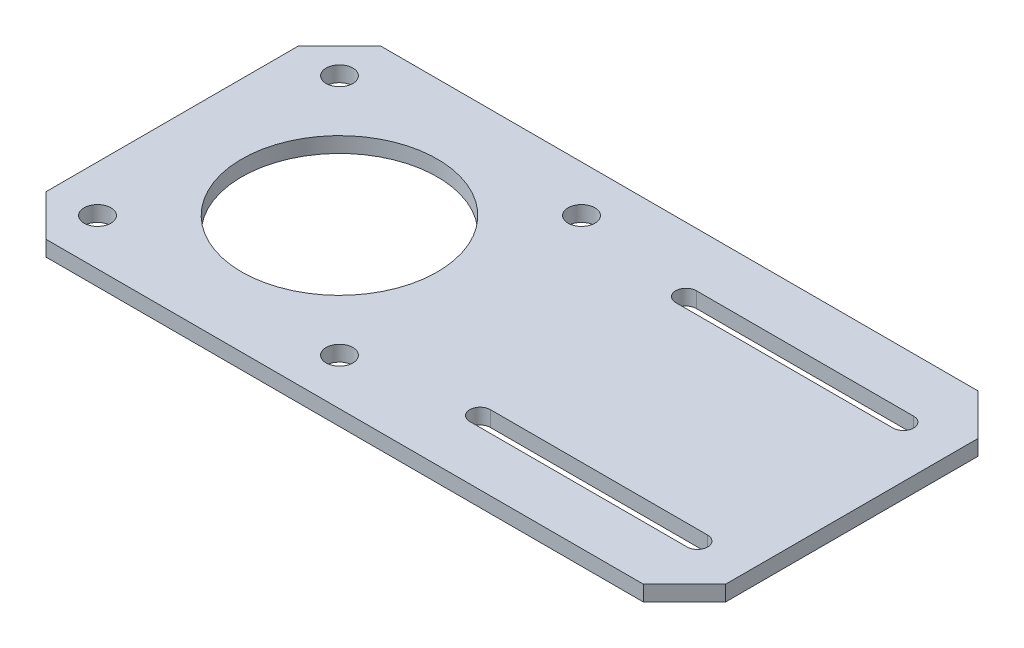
ISO-10303-21;
HEADER;
FILE_DESCRIPTION(('STEP AP214'),'2;1');
FILE_NAME('part.step','',(''),(''),'','','');
FILE_SCHEMA(('AUTOMOTIVE_DESIGN { 1 0 10303 214 1 1 1 1 }'));
ENDSEC;
DATA;
#1=APPLICATION_CONTEXT('core data for automotive mechanical design processes');
#2=APPLICATION_PROTOCOL_DEFINITION('international standard','automotive_design',2000,#1);
#3=PRODUCT_CONTEXT('',#1,'mechanical');
#4=PRODUCT('Part','Part','',(#3));
#5=PRODUCT_RELATED_PRODUCT_CATEGORY('part','',(#4));
#6=PRODUCT_DEFINITION_FORMATION('','',#4);
#7=PRODUCT_DEFINITION_CONTEXT('part definition',#1,'design');
#8=PRODUCT_DEFINITION('design','',#6,#7);
#9=PRODUCT_DEFINITION_SHAPE('','',#8);
#10=(LENGTH_UNIT() NAMED_UNIT(*) SI_UNIT(.MILLI.,.METRE.));
#11=(NAMED_UNIT(*) PLANE_ANGLE_UNIT() SI_UNIT($,.RADIAN.));
#12=(NAMED_UNIT(*) SI_UNIT($,.STERADIAN.) SOLID_ANGLE_UNIT());
#13=UNCERTAINTY_MEASURE_WITH_UNIT(LENGTH_MEASURE(1.E-05),#10,'distance_accuracy_value','');
#14=(GEOMETRIC_REPRESENTATION_CONTEXT(3) GLOBAL_UNCERTAINTY_ASSIGNED_CONTEXT((#13)) GLOBAL_UNIT_ASSIGNED_CONTEXT((#10,
#11,#12)) REPRESENTATION_CONTEXT('',''));
#15=CARTESIAN_POINT('',(0.,0.,0.));
#16=DIRECTION('',(0.,0.,1.));
#17=DIRECTION('',(1.,0.,0.));
#18=AXIS2_PLACEMENT_3D('',#15,#16,#17);
#19=CARTESIAN_POINT('',(0.,3.,0.));
#20=DIRECTION('',(1.,0.,0.));
#21=DIRECTION('',(0.,0.,-1.));
#22=AXIS2_PLACEMENT_3D('',#19,#20,#21);
#23=PLANE('',#22);
#24=DIRECTION('',(0.,0.,1.));
#25=VECTOR('',#24,1.);
#26=CARTESIAN_POINT('',(0.,0.,0.));
#27=LINE('',#26,#25);
#28=CARTESIAN_POINT('',(0.,0.,8.00000000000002));
#29=VERTEX_POINT('',#28);
#30=CARTESIAN_POINT('',(0.,0.,57.));
#31=VERTEX_POINT('',#30);
#32=EDGE_CURVE('E291',#29,#31,#27,.T.);
#33=ORIENTED_EDGE('',*,*,#32,.T.);
#34=DIRECTION('',(0.,1.,0.));
#35=VECTOR('',#34,1.);
#36=CARTESIAN_POINT('',(0.,3.,57.));
#37=LINE('',#36,#35);
#38=CARTESIAN_POINT('',(0.,3.,57.));
#39=VERTEX_POINT('',#38);
#40=EDGE_CURVE('E349',#31,#39,#37,.T.);
#41=ORIENTED_EDGE('',*,*,#40,.T.);
#42=DIRECTION('',(0.,0.,1.));
#43=VECTOR('',#42,1.);
#44=CARTESIAN_POINT('',(0.,3.,0.));
#45=LINE('',#44,#43);
#46=CARTESIAN_POINT('',(0.,3.,8.00000000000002));
#47=VERTEX_POINT('',#46);
#48=EDGE_CURVE('E295',#47,#39,#45,.T.);
#49=ORIENTED_EDGE('',*,*,#48,.F.);
#50=DIRECTION('',(0.,-1.,0.));
#51=VECTOR('',#50,1.);
#52=CARTESIAN_POINT('',(0.,3.,8.00000000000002));
#53=LINE('',#52,#51);
#54=EDGE_CURVE('E345',#47,#29,#53,.T.);
#55=ORIENTED_EDGE('',*,*,#54,.T.);
#56=EDGE_LOOP('',(#33,#41,#49,#55));
#57=FACE_BOUND('',#56,.T.);
#58=ADVANCED_FACE('F47',(#57),#23,.F.);
#59=CARTESIAN_POINT('',(0.,3.,65.));
#60=DIRECTION('',(0.,0.,-1.));
#61=DIRECTION('',(-1.,0.,0.));
#62=AXIS2_PLACEMENT_3D('',#59,#60,#61);
#63=PLANE('',#62);
#64=DIRECTION('',(1.,0.,0.));
#65=VECTOR('',#64,1.);
#66=CARTESIAN_POINT('',(0.,3.,65.));
#67=LINE('',#66,#65);
#68=CARTESIAN_POINT('',(8.,3.,65.));
#69=VERTEX_POINT('',#68);
#70=CARTESIAN_POINT('',(124.,3.,65.));
#71=VERTEX_POINT('',#70);
#72=EDGE_CURVE('E299',#69,#71,#67,.T.);
#73=ORIENTED_EDGE('',*,*,#72,.F.);
#74=DIRECTION('',(0.,-1.,0.));
#75=VECTOR('',#74,1.);
#76=CARTESIAN_POINT('',(8.,3.,65.));
#77=LINE('',#76,#75);
#78=CARTESIAN_POINT('',(8.,0.,65.));
#79=VERTEX_POINT('',#78);
#80=EDGE_CURVE('E329',#69,#79,#77,.T.);
#81=ORIENTED_EDGE('',*,*,#80,.T.);
#82=DIRECTION('',(1.,0.,0.));
#83=VECTOR('',#82,1.);
#84=CARTESIAN_POINT('',(0.,0.,65.));
#85=LINE('',#84,#83);
#86=CARTESIAN_POINT('',(124.,0.,65.));
#87=VERTEX_POINT('',#86);
#88=EDGE_CURVE('E316',#79,#87,#85,.T.);
#89=ORIENTED_EDGE('',*,*,#88,.T.);
#90=DIRECTION('',(0.,1.,0.));
#91=VECTOR('',#90,1.);
#92=CARTESIAN_POINT('',(124.,3.,65.));
#93=LINE('',#92,#91);
#94=EDGE_CURVE('E312',#87,#71,#93,.T.);
#95=ORIENTED_EDGE('',*,*,#94,.T.);
#96=EDGE_LOOP('',(#73,#81,#89,#95));
#97=FACE_BOUND('',#96,.T.);
#98=ADVANCED_FACE('F407',(#97),#63,.F.);
#99=CARTESIAN_POINT('',(132.,3.,0.));
#100=DIRECTION('',(-1.,0.,0.));
#101=DIRECTION('',(0.,0.,1.));
#102=AXIS2_PLACEMENT_3D('',#99,#100,#101);
#103=PLANE('',#102);
#104=DIRECTION('',(0.,0.,-1.));
#105=VECTOR('',#104,1.);
#106=CARTESIAN_POINT('',(132.,0.,0.));
#107=LINE('',#106,#105);
#108=CARTESIAN_POINT('',(132.,0.,57.));
#109=VERTEX_POINT('',#108);
#110=CARTESIAN_POINT('',(132.,0.,8.00000000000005));
#111=VERTEX_POINT('',#110);
#112=EDGE_CURVE('E320',#109,#111,#107,.T.);
#113=ORIENTED_EDGE('',*,*,#112,.T.);
#114=DIRECTION('',(0.,1.,0.));
#115=VECTOR('',#114,1.);
#116=CARTESIAN_POINT('',(132.,3.,8.00000000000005));
#117=LINE('',#116,#115);
#118=CARTESIAN_POINT('',(132.,3.,8.00000000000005));
#119=VERTEX_POINT('',#118);
#120=EDGE_CURVE('E11',#111,#119,#117,.T.);
#121=ORIENTED_EDGE('',*,*,#120,.T.);
#122=DIRECTION('',(0.,0.,-1.));
#123=VECTOR('',#122,1.);
#124=CARTESIAN_POINT('',(132.,3.,0.));
#125=LINE('',#124,#123);
#126=CARTESIAN_POINT('',(132.,3.,57.));
#127=VERTEX_POINT('',#126);
#128=EDGE_CURVE('E304',#127,#119,#125,.T.);
#129=ORIENTED_EDGE('',*,*,#128,.F.);
#130=DIRECTION('',(0.,-1.,0.));
#131=VECTOR('',#130,1.);
#132=CARTESIAN_POINT('',(132.,3.,57.));
#133=LINE('',#132,#131);
#134=EDGE_CURVE('E57',#127,#109,#133,.T.);
#135=ORIENTED_EDGE('',*,*,#134,.T.);
#136=EDGE_LOOP('',(#113,#121,#129,#135));
#137=FACE_BOUND('',#136,.T.);
#138=ADVANCED_FACE('F376',(#137),#103,.F.);
#139=CARTESIAN_POINT('',(0.,3.,0.));
#140=DIRECTION('',(0.,0.,1.));
#141=DIRECTION('',(1.,0.,0.));
#142=AXIS2_PLACEMENT_3D('',#139,#140,#141);
#143=PLANE('',#142);
#144=DIRECTION('',(-1.,0.,0.));
#145=VECTOR('',#144,1.);
#146=CARTESIAN_POINT('',(0.,0.,0.));
#147=LINE('',#146,#145);
#148=CARTESIAN_POINT('',(124.,0.,0.));
#149=VERTEX_POINT('',#148);
#150=CARTESIAN_POINT('',(8.00000000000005,0.,0.));
#151=VERTEX_POINT('',#150);
#152=EDGE_CURVE('E300',#149,#151,#147,.T.);
#153=ORIENTED_EDGE('',*,*,#152,.T.);
#154=DIRECTION('',(0.,1.,0.));
#155=VECTOR('',#154,1.);
#156=CARTESIAN_POINT('',(8.00000000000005,3.,0.));
#157=LINE('',#156,#155);
#158=CARTESIAN_POINT('',(8.00000000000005,3.,0.));
#159=VERTEX_POINT('',#158);
#160=EDGE_CURVE('E368',#151,#159,#157,.T.);
#161=ORIENTED_EDGE('',*,*,#160,.T.);
#162=DIRECTION('',(-1.,0.,0.));
#163=VECTOR('',#162,1.);
#164=CARTESIAN_POINT('',(0.,3.,0.));
#165=LINE('',#164,#163);
#166=CARTESIAN_POINT('',(124.,3.,0.));
#167=VERTEX_POINT('',#166);
#168=EDGE_CURVE('E308',#167,#159,#165,.T.);
#169=ORIENTED_EDGE('',*,*,#168,.F.);
#170=DIRECTION('',(0.,-1.,0.));
#171=VECTOR('',#170,1.);
#172=CARTESIAN_POINT('',(124.,3.,0.));
#173=LINE('',#172,#171);
#174=EDGE_CURVE('E364',#167,#149,#173,.T.);
#175=ORIENTED_EDGE('',*,*,#174,.T.);
#176=EDGE_LOOP('',(#153,#161,#169,#175));
#177=FACE_BOUND('',#176,.T.);
#178=ADVANCED_FACE('F389',(#177),#143,.F.);
#179=CARTESIAN_POINT('',(0.,3.,0.));
#180=DIRECTION('',(0.,1.,0.));
#181=DIRECTION('',(0.,0.,1.));
#182=AXIS2_PLACEMENT_3D('',#179,#180,#181);
#183=PLANE('',#182);
#184=CARTESIAN_POINT('',(122.,3.,12.5));
#185=DIRECTION('',(0.,1.,0.));
#186=DIRECTION('',(0.,0.,1.));
#187=AXIS2_PLACEMENT_3D('',#184,#185,#186);
#188=CIRCLE('',#187,2.);
#189=CARTESIAN_POINT('',(122.,3.,14.5));
#190=VERTEX_POINT('',#189);
#191=CARTESIAN_POINT('',(122.,3.,10.5));
#192=VERTEX_POINT('',#191);
#193=EDGE_CURVE('E64',#190,#192,#188,.T.);
#194=ORIENTED_EDGE('',*,*,#193,.F.);
#195=DIRECTION('',(1.,0.,0.));
#196=VECTOR('',#195,1.);
#197=CARTESIAN_POINT('',(122.,3.,14.5));
#198=LINE('',#197,#196);
#199=CARTESIAN_POINT('',(79.8,3.,14.5));
#200=VERTEX_POINT('',#199);
#201=EDGE_CURVE('E185',#200,#190,#198,.T.);
#202=ORIENTED_EDGE('',*,*,#201,.F.);
#203=CARTESIAN_POINT('',(79.8,3.,12.5));
#204=DIRECTION('',(0.,1.,0.));
#205=DIRECTION('',(0.,0.,1.));
#206=AXIS2_PLACEMENT_3D('',#203,#204,#205);
#207=CIRCLE('',#206,2.);
#208=CARTESIAN_POINT('',(79.8,3.,10.5));
#209=VERTEX_POINT('',#208);
#210=EDGE_CURVE('E189',#209,#200,#207,.T.);
#211=ORIENTED_EDGE('',*,*,#210,.F.);
#212=DIRECTION('',(-1.,0.,0.));
#213=VECTOR('',#212,1.);
#214=CARTESIAN_POINT('',(122.,3.,10.5));
#215=LINE('',#214,#213);
#216=EDGE_CURVE('E198',#192,#209,#215,.T.);
#217=ORIENTED_EDGE('',*,*,#216,.F.);
#218=EDGE_LOOP('',(#194,#202,#211,#217));
#219=FACE_BOUND('',#218,.T.);
#220=CARTESIAN_POINT('',(122.,3.,52.5));
#221=DIRECTION('',(0.,1.,0.));
#222=DIRECTION('',(0.,0.,1.));
#223=AXIS2_PLACEMENT_3D('',#220,#221,#222);
#224=CIRCLE('',#223,2.00000000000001);
#225=CARTESIAN_POINT('',(122.,3.,54.5));
#226=VERTEX_POINT('',#225);
#227=CARTESIAN_POINT('',(122.,3.,50.5));
#228=VERTEX_POINT('',#227);
#229=EDGE_CURVE('E72',#226,#228,#224,.T.);
#230=ORIENTED_EDGE('',*,*,#229,.F.);
#231=DIRECTION('',(1.,0.,0.));
#232=VECTOR('',#231,1.);
#233=CARTESIAN_POINT('',(122.,3.,54.5));
#234=LINE('',#233,#232);
#235=CARTESIAN_POINT('',(79.8,3.,54.5));
#236=VERTEX_POINT('',#235);
#237=EDGE_CURVE('E226',#236,#226,#234,.T.);
#238=ORIENTED_EDGE('',*,*,#237,.F.);
#239=CARTESIAN_POINT('',(79.8,3.,52.5));
#240=DIRECTION('',(0.,1.,0.));
#241=DIRECTION('',(0.,0.,1.));
#242=AXIS2_PLACEMENT_3D('',#239,#240,#241);
#243=CIRCLE('',#242,2.);
#244=CARTESIAN_POINT('',(79.8,3.,50.5));
#245=VERTEX_POINT('',#244);
#246=EDGE_CURVE('E230',#245,#236,#243,.T.);
#247=ORIENTED_EDGE('',*,*,#246,.F.);
#248=DIRECTION('',(-1.,0.,0.));
#249=VECTOR('',#248,1.);
#250=CARTESIAN_POINT('',(122.,3.,50.5));
#251=LINE('',#250,#249);
#252=EDGE_CURVE('E235',#228,#245,#251,.T.);
#253=ORIENTED_EDGE('',*,*,#252,.F.);
#254=EDGE_LOOP('',(#230,#238,#247,#253));
#255=FACE_BOUND('',#254,.T.);
#256=CARTESIAN_POINT('',(9.,3.,9.));
#257=DIRECTION('',(0.,1.,0.));
#258=DIRECTION('',(0.,0.,-1.));
#259=AXIS2_PLACEMENT_3D('',#256,#257,#258);
#260=CIRCLE('',#259,2.6);
#261=CARTESIAN_POINT('',(9.,3.,6.4));
#262=VERTEX_POINT('',#261);
#263=EDGE_CURVE('E280',#262,#262,#260,.T.);
#264=ORIENTED_EDGE('',*,*,#263,.F.);
#265=EDGE_LOOP('',(#264));
#266=FACE_BOUND('',#265,.T.);
#267=CARTESIAN_POINT('',(56.,3.,9.));
#268=DIRECTION('',(0.,1.,0.));
#269=DIRECTION('',(0.,0.,1.));
#270=AXIS2_PLACEMENT_3D('',#267,#268,#269);
#271=CIRCLE('',#270,2.6);
#272=CARTESIAN_POINT('',(56.,3.,11.6));
#273=VERTEX_POINT('',#272);
#274=EDGE_CURVE('E272',#273,#273,#271,.T.);
#275=ORIENTED_EDGE('',*,*,#274,.F.);
#276=EDGE_LOOP('',(#275));
#277=FACE_BOUND('',#276,.T.);
#278=CARTESIAN_POINT('',(56.,3.,56.));
#279=DIRECTION('',(0.,1.,0.));
#280=DIRECTION('',(0.,0.,-1.));
#281=AXIS2_PLACEMENT_3D('',#278,#279,#280);
#282=CIRCLE('',#281,2.6);
#283=CARTESIAN_POINT('',(56.,3.,53.4));
#284=VERTEX_POINT('',#283);
#285=EDGE_CURVE('E264',#284,#284,#282,.T.);
#286=ORIENTED_EDGE('',*,*,#285,.F.);
#287=EDGE_LOOP('',(#286));
#288=FACE_BOUND('',#287,.T.);
#289=CARTESIAN_POINT('',(9.,3.,56.));
#290=DIRECTION('',(0.,1.,0.));
#291=DIRECTION('',(0.,0.,1.));
#292=AXIS2_PLACEMENT_3D('',#289,#290,#291);
#293=CIRCLE('',#292,2.6);
#294=CARTESIAN_POINT('',(9.,3.,58.6));
#295=VERTEX_POINT('',#294);
#296=EDGE_CURVE('E255',#295,#295,#293,.T.);
#297=ORIENTED_EDGE('',*,*,#296,.F.);
#298=EDGE_LOOP('',(#297));
#299=FACE_BOUND('',#298,.T.);
#300=CARTESIAN_POINT('',(32.5,3.,32.5));
#301=DIRECTION('',(0.,1.,0.));
#302=DIRECTION('',(0.,0.,1.));
#303=AXIS2_PLACEMENT_3D('',#300,#301,#302);
#304=CIRCLE('',#303,19.);
#305=CARTESIAN_POINT('',(32.5,3.,51.5));
#306=VERTEX_POINT('',#305);
#307=EDGE_CURVE('E259',#306,#306,#304,.T.);
#308=ORIENTED_EDGE('',*,*,#307,.F.);
#309=EDGE_LOOP('',(#308));
#310=FACE_BOUND('',#309,.T.);
#311=ORIENTED_EDGE('',*,*,#48,.T.);
#312=DIRECTION('',(-0.707106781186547,0.,-0.707106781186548));
#313=VECTOR('',#312,1.);
#314=CARTESIAN_POINT('',(-28.5,3.,28.4999999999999));
#315=LINE('',#314,#313);
#316=EDGE_CURVE('E361',#39,#69,#315,.F.);
#317=ORIENTED_EDGE('',*,*,#316,.T.);
#318=ORIENTED_EDGE('',*,*,#72,.T.);
#319=DIRECTION('',(-0.707106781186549,0.,0.707106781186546));
#320=VECTOR('',#319,1.);
#321=CARTESIAN_POINT('',(94.4999999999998,3.,94.5000000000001));
#322=LINE('',#321,#320);
#323=EDGE_CURVE('E352',#71,#127,#322,.F.);
#324=ORIENTED_EDGE('',*,*,#323,.T.);
#325=ORIENTED_EDGE('',*,*,#128,.T.);
#326=DIRECTION('',(0.707106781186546,0.,0.707106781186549));
#327=VECTOR('',#326,1.);
#328=CARTESIAN_POINT('',(62.0000000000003,3.,-62.));
#329=LINE('',#328,#327);
#330=EDGE_CURVE('E355',#119,#167,#329,.F.);
#331=ORIENTED_EDGE('',*,*,#330,.T.);
#332=ORIENTED_EDGE('',*,*,#168,.T.);
#333=DIRECTION('',(0.707106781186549,0.,-0.707106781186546));
#334=VECTOR('',#333,1.);
#335=CARTESIAN_POINT('',(4.00000000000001,3.,4.00000000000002));
#336=LINE('',#335,#334);
#337=EDGE_CURVE('E358',#159,#47,#336,.F.);
#338=ORIENTED_EDGE('',*,*,#337,.T.);
#339=EDGE_LOOP('',(#311,#317,#318,#324,#325,#331,#332,#338));
#340=FACE_BOUND('',#339,.T.);
#341=ADVANCED_FACE('F393',(#219,#255,#266,#277,#288,#299,#310,#340),#183,.T.);
#342=CARTESIAN_POINT('',(0.,0.,0.));
#343=DIRECTION('',(0.,1.,0.));
#344=DIRECTION('',(0.,0.,1.));
#345=AXIS2_PLACEMENT_3D('',#342,#343,#344);
#346=PLANE('',#345);
#347=DIRECTION('',(1.,0.,0.));
#348=VECTOR('',#347,1.);
#349=CARTESIAN_POINT('',(122.,0.,14.5));
#350=LINE('',#349,#348);
#351=CARTESIAN_POINT('',(79.8,0.,14.5));
#352=VERTEX_POINT('',#351);
#353=CARTESIAN_POINT('',(122.,0.,14.5));
#354=VERTEX_POINT('',#353);
#355=EDGE_CURVE('E170',#352,#354,#350,.T.);
#356=ORIENTED_EDGE('',*,*,#355,.T.);
#357=CARTESIAN_POINT('',(122.,0.,12.5));
#358=DIRECTION('',(0.,1.,0.));
#359=DIRECTION('',(0.,0.,1.));
#360=AXIS2_PLACEMENT_3D('',#357,#358,#359);
#361=CIRCLE('',#360,2.);
#362=CARTESIAN_POINT('',(122.,0.,10.5));
#363=VERTEX_POINT('',#362);
#364=EDGE_CURVE('E163',#354,#363,#361,.T.);
#365=ORIENTED_EDGE('',*,*,#364,.T.);
#366=DIRECTION('',(-1.,0.,0.));
#367=VECTOR('',#366,1.);
#368=CARTESIAN_POINT('',(122.,0.,10.5));
#369=LINE('',#368,#367);
#370=CARTESIAN_POINT('',(79.8,0.,10.5));
#371=VERTEX_POINT('',#370);
#372=EDGE_CURVE('E174',#363,#371,#369,.T.);
#373=ORIENTED_EDGE('',*,*,#372,.T.);
#374=CARTESIAN_POINT('',(79.8,0.,12.5));
#375=DIRECTION('',(0.,1.,0.));
#376=DIRECTION('',(0.,0.,1.));
#377=AXIS2_PLACEMENT_3D('',#374,#375,#376);
#378=CIRCLE('',#377,2.);
#379=EDGE_CURVE('E179',#371,#352,#378,.T.);
#380=ORIENTED_EDGE('',*,*,#379,.T.);
#381=EDGE_LOOP('',(#356,#365,#373,#380));
#382=FACE_BOUND('',#381,.T.);
#383=DIRECTION('',(1.,0.,0.));
#384=VECTOR('',#383,1.);
#385=CARTESIAN_POINT('',(122.,0.,54.5));
#386=LINE('',#385,#384);
#387=CARTESIAN_POINT('',(79.8,0.,54.5));
#388=VERTEX_POINT('',#387);
#389=CARTESIAN_POINT('',(122.,0.,54.5));
#390=VERTEX_POINT('',#389);
#391=EDGE_CURVE('E216',#388,#390,#386,.T.);
#392=ORIENTED_EDGE('',*,*,#391,.T.);
#393=CARTESIAN_POINT('',(122.,0.,52.5));
#394=DIRECTION('',(0.,1.,0.));
#395=DIRECTION('',(0.,0.,1.));
#396=AXIS2_PLACEMENT_3D('',#393,#394,#395);
#397=CIRCLE('',#396,2.00000000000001);
#398=CARTESIAN_POINT('',(122.,0.,50.5));
#399=VERTEX_POINT('',#398);
#400=EDGE_CURVE('E231',#390,#399,#397,.T.);
#401=ORIENTED_EDGE('',*,*,#400,.T.);
#402=DIRECTION('',(-1.,0.,0.));
#403=VECTOR('',#402,1.);
#404=CARTESIAN_POINT('',(122.,0.,50.5));
#405=LINE('',#404,#403);
#406=CARTESIAN_POINT('',(79.8,0.,50.5));
#407=VERTEX_POINT('',#406);
#408=EDGE_CURVE('E248',#399,#407,#405,.T.);
#409=ORIENTED_EDGE('',*,*,#408,.T.);
#410=CARTESIAN_POINT('',(79.8,0.,52.5));
#411=DIRECTION('',(0.,1.,0.));
#412=DIRECTION('',(0.,0.,1.));
#413=AXIS2_PLACEMENT_3D('',#410,#411,#412);
#414=CIRCLE('',#413,2.);
#415=EDGE_CURVE('E244',#407,#388,#414,.T.);
#416=ORIENTED_EDGE('',*,*,#415,.T.);
#417=EDGE_LOOP('',(#392,#401,#409,#416));
#418=FACE_BOUND('',#417,.T.);
#419=CARTESIAN_POINT('',(9.,0.,9.));
#420=DIRECTION('',(0.,1.,0.));
#421=DIRECTION('',(0.,0.,-1.));
#422=AXIS2_PLACEMENT_3D('',#419,#420,#421);
#423=CIRCLE('',#422,2.6);
#424=CARTESIAN_POINT('',(9.,0.,6.4));
#425=VERTEX_POINT('',#424);
#426=EDGE_CURVE('E207',#425,#425,#423,.T.);
#427=ORIENTED_EDGE('',*,*,#426,.T.);
#428=EDGE_LOOP('',(#427));
#429=FACE_BOUND('',#428,.T.);
#430=CARTESIAN_POINT('',(56.,0.,9.));
#431=DIRECTION('',(0.,1.,0.));
#432=DIRECTION('',(0.,0.,1.));
#433=AXIS2_PLACEMENT_3D('',#430,#431,#432);
#434=CIRCLE('',#433,2.6);
#435=CARTESIAN_POINT('',(56.,0.,11.6));
#436=VERTEX_POINT('',#435);
#437=EDGE_CURVE('E276',#436,#436,#434,.T.);
#438=ORIENTED_EDGE('',*,*,#437,.T.);
#439=EDGE_LOOP('',(#438));
#440=FACE_BOUND('',#439,.T.);
#441=CARTESIAN_POINT('',(56.,0.,56.));
#442=DIRECTION('',(0.,1.,0.));
#443=DIRECTION('',(0.,0.,-1.));
#444=AXIS2_PLACEMENT_3D('',#441,#442,#443);
#445=CIRCLE('',#444,2.6);
#446=CARTESIAN_POINT('',(56.,0.,53.4));
#447=VERTEX_POINT('',#446);
#448=EDGE_CURVE('E268',#447,#447,#445,.T.);
#449=ORIENTED_EDGE('',*,*,#448,.T.);
#450=EDGE_LOOP('',(#449));
#451=FACE_BOUND('',#450,.T.);
#452=CARTESIAN_POINT('',(9.,0.,56.));
#453=DIRECTION('',(0.,1.,0.));
#454=DIRECTION('',(0.,0.,1.));
#455=AXIS2_PLACEMENT_3D('',#452,#453,#454);
#456=CIRCLE('',#455,2.6);
#457=CARTESIAN_POINT('',(9.,0.,58.6));
#458=VERTEX_POINT('',#457);
#459=EDGE_CURVE('E260',#458,#458,#456,.T.);
#460=ORIENTED_EDGE('',*,*,#459,.T.);
#461=EDGE_LOOP('',(#460));
#462=FACE_BOUND('',#461,.T.);
#463=CARTESIAN_POINT('',(32.5,0.,32.5));
#464=DIRECTION('',(0.,1.,0.));
#465=DIRECTION('',(0.,0.,1.));
#466=AXIS2_PLACEMENT_3D('',#463,#464,#465);
#467=CIRCLE('',#466,19.);
#468=CARTESIAN_POINT('',(32.5,0.,51.5));
#469=VERTEX_POINT('',#468);
#470=EDGE_CURVE('E287',#469,#469,#467,.T.);
#471=ORIENTED_EDGE('',*,*,#470,.T.);
#472=EDGE_LOOP('',(#471));
#473=FACE_BOUND('',#472,.T.);
#474=ORIENTED_EDGE('',*,*,#88,.F.);
#475=DIRECTION('',(0.707106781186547,0.,0.707106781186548));
#476=VECTOR('',#475,1.);
#477=CARTESIAN_POINT('',(8.,0.,65.));
#478=LINE('',#477,#476);
#479=EDGE_CURVE('E342',#79,#31,#478,.F.);
#480=ORIENTED_EDGE('',*,*,#479,.T.);
#481=ORIENTED_EDGE('',*,*,#32,.F.);
#482=DIRECTION('',(-0.707106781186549,0.,0.707106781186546));
#483=VECTOR('',#482,1.);
#484=CARTESIAN_POINT('',(0.,0.,8.00000000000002));
#485=LINE('',#484,#483);
#486=EDGE_CURVE('E339',#29,#151,#485,.F.);
#487=ORIENTED_EDGE('',*,*,#486,.T.);
#488=ORIENTED_EDGE('',*,*,#152,.F.);
#489=DIRECTION('',(-0.707106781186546,0.,-0.707106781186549));
#490=VECTOR('',#489,1.);
#491=CARTESIAN_POINT('',(124.,0.,0.));
#492=LINE('',#491,#490);
#493=EDGE_CURVE('E336',#149,#111,#492,.F.);
#494=ORIENTED_EDGE('',*,*,#493,.T.);
#495=ORIENTED_EDGE('',*,*,#112,.F.);
#496=DIRECTION('',(0.707106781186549,0.,-0.707106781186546));
#497=VECTOR('',#496,1.);
#498=CARTESIAN_POINT('',(132.,0.,57.));
#499=LINE('',#498,#497);
#500=EDGE_CURVE('E333',#109,#87,#499,.F.);
#501=ORIENTED_EDGE('',*,*,#500,.T.);
#502=EDGE_LOOP('',(#474,#480,#481,#487,#488,#494,#495,#501));
#503=FACE_BOUND('',#502,.T.);
#504=ADVANCED_FACE('F181',(#382,#418,#429,#440,#451,#462,#473,#503),#346,.F.);
#505=CARTESIAN_POINT('',(8.,3.,65.));
#506=DIRECTION('',(0.707106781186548,0.,-0.707106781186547));
#507=DIRECTION('',(0.,-1.,0.));
#508=AXIS2_PLACEMENT_3D('',#505,#506,#507);
#509=PLANE('',#508);
#510=ORIENTED_EDGE('',*,*,#316,.F.);
#511=ORIENTED_EDGE('',*,*,#40,.F.);
#512=ORIENTED_EDGE('',*,*,#479,.F.);
#513=ORIENTED_EDGE('',*,*,#80,.F.);
#514=EDGE_LOOP('',(#510,#511,#512,#513));
#515=FACE_BOUND('',#514,.T.);
#516=ADVANCED_FACE('F404',(#515),#509,.F.);
#517=CARTESIAN_POINT('',(0.,3.,8.00000000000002));
#518=DIRECTION('',(0.707106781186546,0.,0.707106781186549));
#519=DIRECTION('',(0.,-1.,0.));
#520=AXIS2_PLACEMENT_3D('',#517,#518,#519);
#521=PLANE('',#520);
#522=ORIENTED_EDGE('',*,*,#337,.F.);
#523=ORIENTED_EDGE('',*,*,#160,.F.);
#524=ORIENTED_EDGE('',*,*,#486,.F.);
#525=ORIENTED_EDGE('',*,*,#54,.F.);
#526=EDGE_LOOP('',(#522,#523,#524,#525));
#527=FACE_BOUND('',#526,.T.);
#528=ADVANCED_FACE('F397',(#527),#521,.F.);
#529=CARTESIAN_POINT('',(124.,3.,0.));
#530=DIRECTION('',(-0.707106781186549,0.,0.707106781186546));
#531=DIRECTION('',(0.,-1.,0.));
#532=AXIS2_PLACEMENT_3D('',#529,#530,#531);
#533=PLANE('',#532);
#534=ORIENTED_EDGE('',*,*,#330,.F.);
#535=ORIENTED_EDGE('',*,*,#120,.F.);
#536=ORIENTED_EDGE('',*,*,#493,.F.);
#537=ORIENTED_EDGE('',*,*,#174,.F.);
#538=EDGE_LOOP('',(#534,#535,#536,#537));
#539=FACE_BOUND('',#538,.T.);
#540=ADVANCED_FACE('F386',(#539),#533,.F.);
#541=CARTESIAN_POINT('',(132.,3.,57.));
#542=DIRECTION('',(-0.707106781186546,0.,-0.707106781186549));
#543=DIRECTION('',(0.,-1.,0.));
#544=AXIS2_PLACEMENT_3D('',#541,#542,#543);
#545=PLANE('',#544);
#546=ORIENTED_EDGE('',*,*,#323,.F.);
#547=ORIENTED_EDGE('',*,*,#94,.F.);
#548=ORIENTED_EDGE('',*,*,#500,.F.);
#549=ORIENTED_EDGE('',*,*,#134,.F.);
#550=EDGE_LOOP('',(#546,#547,#548,#549));
#551=FACE_BOUND('',#550,.T.);
#552=ADVANCED_FACE('F50',(#551),#545,.F.);
#553=CARTESIAN_POINT('',(32.5,0.,32.5));
#554=DIRECTION('',(0.,1.,0.));
#555=DIRECTION('',(0.,0.,1.));
#556=AXIS2_PLACEMENT_3D('',#553,#554,#555);
#557=CYLINDRICAL_SURFACE('',#556,19.);
#558=ORIENTED_EDGE('',*,*,#470,.F.);
#559=EDGE_LOOP('',(#558));
#560=FACE_BOUND('',#559,.T.);
#561=ORIENTED_EDGE('',*,*,#307,.T.);
#562=EDGE_LOOP('',(#561));
#563=FACE_BOUND('',#562,.T.);
#564=ADVANCED_FACE('F410',(#560,#563),#557,.F.);
#565=CARTESIAN_POINT('',(9.,0.,56.));
#566=DIRECTION('',(0.,1.,0.));
#567=DIRECTION('',(0.,0.,1.));
#568=AXIS2_PLACEMENT_3D('',#565,#566,#567);
#569=CYLINDRICAL_SURFACE('',#568,2.6);
#570=ORIENTED_EDGE('',*,*,#459,.F.);
#571=EDGE_LOOP('',(#570));
#572=FACE_BOUND('',#571,.T.);
#573=ORIENTED_EDGE('',*,*,#296,.T.);
#574=EDGE_LOOP('',(#573));
#575=FACE_BOUND('',#574,.T.);
#576=ADVANCED_FACE('F415',(#572,#575),#569,.F.);
#577=CARTESIAN_POINT('',(56.,0.,56.));
#578=DIRECTION('',(0.,1.,0.));
#579=DIRECTION('',(0.,0.,1.));
#580=AXIS2_PLACEMENT_3D('',#577,#578,#579);
#581=CYLINDRICAL_SURFACE('',#580,2.6);
#582=ORIENTED_EDGE('',*,*,#448,.F.);
#583=EDGE_LOOP('',(#582));
#584=FACE_BOUND('',#583,.T.);
#585=ORIENTED_EDGE('',*,*,#285,.T.);
#586=EDGE_LOOP('',(#585));
#587=FACE_BOUND('',#586,.T.);
#588=ADVANCED_FACE('F470',(#584,#587),#581,.F.);
#589=CARTESIAN_POINT('',(56.,0.,9.));
#590=DIRECTION('',(0.,1.,0.));
#591=DIRECTION('',(0.,0.,1.));
#592=AXIS2_PLACEMENT_3D('',#589,#590,#591);
#593=CYLINDRICAL_SURFACE('',#592,2.6);
#594=ORIENTED_EDGE('',*,*,#437,.F.);
#595=EDGE_LOOP('',(#594));
#596=FACE_BOUND('',#595,.T.);
#597=ORIENTED_EDGE('',*,*,#274,.T.);
#598=EDGE_LOOP('',(#597));
#599=FACE_BOUND('',#598,.T.);
#600=ADVANCED_FACE('F480',(#596,#599),#593,.F.);
#601=CARTESIAN_POINT('',(9.,0.,9.));
#602=DIRECTION('',(0.,1.,0.));
#603=DIRECTION('',(0.,0.,1.));
#604=AXIS2_PLACEMENT_3D('',#601,#602,#603);
#605=CYLINDRICAL_SURFACE('',#604,2.6);
#606=ORIENTED_EDGE('',*,*,#426,.F.);
#607=EDGE_LOOP('',(#606));
#608=FACE_BOUND('',#607,.T.);
#609=ORIENTED_EDGE('',*,*,#263,.T.);
#610=EDGE_LOOP('',(#609));
#611=FACE_BOUND('',#610,.T.);
#612=ADVANCED_FACE('F490',(#608,#611),#605,.F.);
#613=CARTESIAN_POINT('',(122.,0.,52.5));
#614=DIRECTION('',(0.,1.,0.));
#615=DIRECTION('',(0.,0.,1.));
#616=AXIS2_PLACEMENT_3D('',#613,#614,#615);
#617=CYLINDRICAL_SURFACE('',#616,2.00000000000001);
#618=ORIENTED_EDGE('',*,*,#229,.T.);
#619=DIRECTION('',(0.,1.,0.));
#620=VECTOR('',#619,1.);
#621=CARTESIAN_POINT('',(122.,0.,50.5));
#622=LINE('',#621,#620);
#623=EDGE_CURVE('E213',#399,#228,#622,.T.);
#624=ORIENTED_EDGE('',*,*,#623,.F.);
#625=ORIENTED_EDGE('',*,*,#400,.F.);
#626=DIRECTION('',(0.,1.,0.));
#627=VECTOR('',#626,1.);
#628=CARTESIAN_POINT('',(122.,0.,54.5));
#629=LINE('',#628,#627);
#630=EDGE_CURVE('E223',#390,#226,#629,.T.);
#631=ORIENTED_EDGE('',*,*,#630,.T.);
#632=EDGE_LOOP('',(#618,#624,#625,#631));
#633=FACE_BOUND('',#632,.T.);
#634=ADVANCED_FACE('F500',(#633),#617,.F.);
#635=CARTESIAN_POINT('',(122.,0.,54.5));
#636=DIRECTION('',(0.,0.,1.));
#637=DIRECTION('',(1.,0.,0.));
#638=AXIS2_PLACEMENT_3D('',#635,#636,#637);
#639=PLANE('',#638);
#640=ORIENTED_EDGE('',*,*,#237,.T.);
#641=ORIENTED_EDGE('',*,*,#630,.F.);
#642=ORIENTED_EDGE('',*,*,#391,.F.);
#643=DIRECTION('',(0.,1.,0.));
#644=VECTOR('',#643,1.);
#645=CARTESIAN_POINT('',(79.8,0.,54.5));
#646=LINE('',#645,#644);
#647=EDGE_CURVE('E220',#388,#236,#646,.T.);
#648=ORIENTED_EDGE('',*,*,#647,.T.);
#649=EDGE_LOOP('',(#640,#641,#642,#648));
#650=FACE_BOUND('',#649,.T.);
#651=ADVANCED_FACE('F511',(#650),#639,.F.);
#652=CARTESIAN_POINT('',(79.8,0.,52.5));
#653=DIRECTION('',(0.,1.,0.));
#654=DIRECTION('',(0.,0.,1.));
#655=AXIS2_PLACEMENT_3D('',#652,#653,#654);
#656=CYLINDRICAL_SURFACE('',#655,2.);
#657=ORIENTED_EDGE('',*,*,#246,.T.);
#658=ORIENTED_EDGE('',*,*,#647,.F.);
#659=ORIENTED_EDGE('',*,*,#415,.F.);
#660=DIRECTION('',(0.,1.,0.));
#661=VECTOR('',#660,1.);
#662=CARTESIAN_POINT('',(79.8,0.,50.5));
#663=LINE('',#662,#661);
#664=EDGE_CURVE('E217',#407,#245,#663,.T.);
#665=ORIENTED_EDGE('',*,*,#664,.T.);
#666=EDGE_LOOP('',(#657,#658,#659,#665));
#667=FACE_BOUND('',#666,.T.);
#668=ADVANCED_FACE('F521',(#667),#656,.F.);
#669=CARTESIAN_POINT('',(122.,0.,50.5));
#670=DIRECTION('',(0.,0.,-1.));
#671=DIRECTION('',(-1.,0.,0.));
#672=AXIS2_PLACEMENT_3D('',#669,#670,#671);
#673=PLANE('',#672);
#674=ORIENTED_EDGE('',*,*,#252,.T.);
#675=ORIENTED_EDGE('',*,*,#664,.F.);
#676=ORIENTED_EDGE('',*,*,#408,.F.);
#677=ORIENTED_EDGE('',*,*,#623,.T.);
#678=EDGE_LOOP('',(#674,#675,#676,#677));
#679=FACE_BOUND('',#678,.T.);
#680=ADVANCED_FACE('F531',(#679),#673,.F.);
#681=CARTESIAN_POINT('',(122.,0.,12.5));
#682=DIRECTION('',(0.,1.,0.));
#683=DIRECTION('',(0.,0.,1.));
#684=AXIS2_PLACEMENT_3D('',#681,#682,#683);
#685=CYLINDRICAL_SURFACE('',#684,2.);
#686=ORIENTED_EDGE('',*,*,#193,.T.);
#687=DIRECTION('',(0.,1.,0.));
#688=VECTOR('',#687,1.);
#689=CARTESIAN_POINT('',(122.,0.,10.5));
#690=LINE('',#689,#688);
#691=EDGE_CURVE('E159',#363,#192,#690,.T.);
#692=ORIENTED_EDGE('',*,*,#691,.F.);
#693=ORIENTED_EDGE('',*,*,#364,.F.);
#694=DIRECTION('',(0.,1.,0.));
#695=VECTOR('',#694,1.);
#696=CARTESIAN_POINT('',(122.,0.,14.5));
#697=LINE('',#696,#695);
#698=EDGE_CURVE('E204',#354,#190,#697,.T.);
#699=ORIENTED_EDGE('',*,*,#698,.T.);
#700=EDGE_LOOP('',(#686,#692,#693,#699));
#701=FACE_BOUND('',#700,.T.);
#702=ADVANCED_FACE('F161',(#701),#685,.F.);
#703=CARTESIAN_POINT('',(122.,0.,14.5));
#704=DIRECTION('',(0.,0.,1.));
#705=DIRECTION('',(1.,0.,0.));
#706=AXIS2_PLACEMENT_3D('',#703,#704,#705);
#707=PLANE('',#706);
#708=ORIENTED_EDGE('',*,*,#201,.T.);
#709=ORIENTED_EDGE('',*,*,#698,.F.);
#710=ORIENTED_EDGE('',*,*,#355,.F.);
#711=DIRECTION('',(0.,1.,0.));
#712=VECTOR('',#711,1.);
#713=CARTESIAN_POINT('',(79.8,0.,14.5));
#714=LINE('',#713,#712);
#715=EDGE_CURVE('E208',#352,#200,#714,.T.);
#716=ORIENTED_EDGE('',*,*,#715,.T.);
#717=EDGE_LOOP('',(#708,#709,#710,#716));
#718=FACE_BOUND('',#717,.T.);
#719=ADVANCED_FACE('F550',(#718),#707,.F.);
#720=CARTESIAN_POINT('',(79.8,0.,12.5));
#721=DIRECTION('',(0.,1.,0.));
#722=DIRECTION('',(0.,0.,1.));
#723=AXIS2_PLACEMENT_3D('',#720,#721,#722);
#724=CYLINDRICAL_SURFACE('',#723,2.);
#725=ORIENTED_EDGE('',*,*,#210,.T.);
#726=ORIENTED_EDGE('',*,*,#715,.F.);
#727=ORIENTED_EDGE('',*,*,#379,.F.);
#728=DIRECTION('',(0.,1.,0.));
#729=VECTOR('',#728,1.);
#730=CARTESIAN_POINT('',(79.8,0.,10.5));
#731=LINE('',#730,#729);
#732=EDGE_CURVE('E169',#371,#209,#731,.T.);
#733=ORIENTED_EDGE('',*,*,#732,.T.);
#734=EDGE_LOOP('',(#725,#726,#727,#733));
#735=FACE_BOUND('',#734,.T.);
#736=ADVANCED_FACE('F559',(#735),#724,.F.);
#737=CARTESIAN_POINT('',(122.,0.,10.5));
#738=DIRECTION('',(0.,0.,-1.));
#739=DIRECTION('',(-1.,0.,0.));
#740=AXIS2_PLACEMENT_3D('',#737,#738,#739);
#741=PLANE('',#740);
#742=ORIENTED_EDGE('',*,*,#216,.T.);
#743=ORIENTED_EDGE('',*,*,#732,.F.);
#744=ORIENTED_EDGE('',*,*,#372,.F.);
#745=ORIENTED_EDGE('',*,*,#691,.T.);
#746=EDGE_LOOP('',(#742,#743,#744,#745));
#747=FACE_BOUND('',#746,.T.);
#748=ADVANCED_FACE('F175',(#747),#741,.F.);
#749=CLOSED_SHELL('',(#58,#98,#138,#178,#341,#504,#516,#528,#540,#552,#564,#576,#588,#600,#612,
#634,#651,#668,#680,#702,#719,#736,#748));
#750=MANIFOLD_SOLID_BREP('B2',#749);
#751=ADVANCED_BREP_SHAPE_REPRESENTATION('',(#18,#750),#14);
#752=SHAPE_DEFINITION_REPRESENTATION(#9,#751);
ENDSEC;
END-ISO-10303-21;
